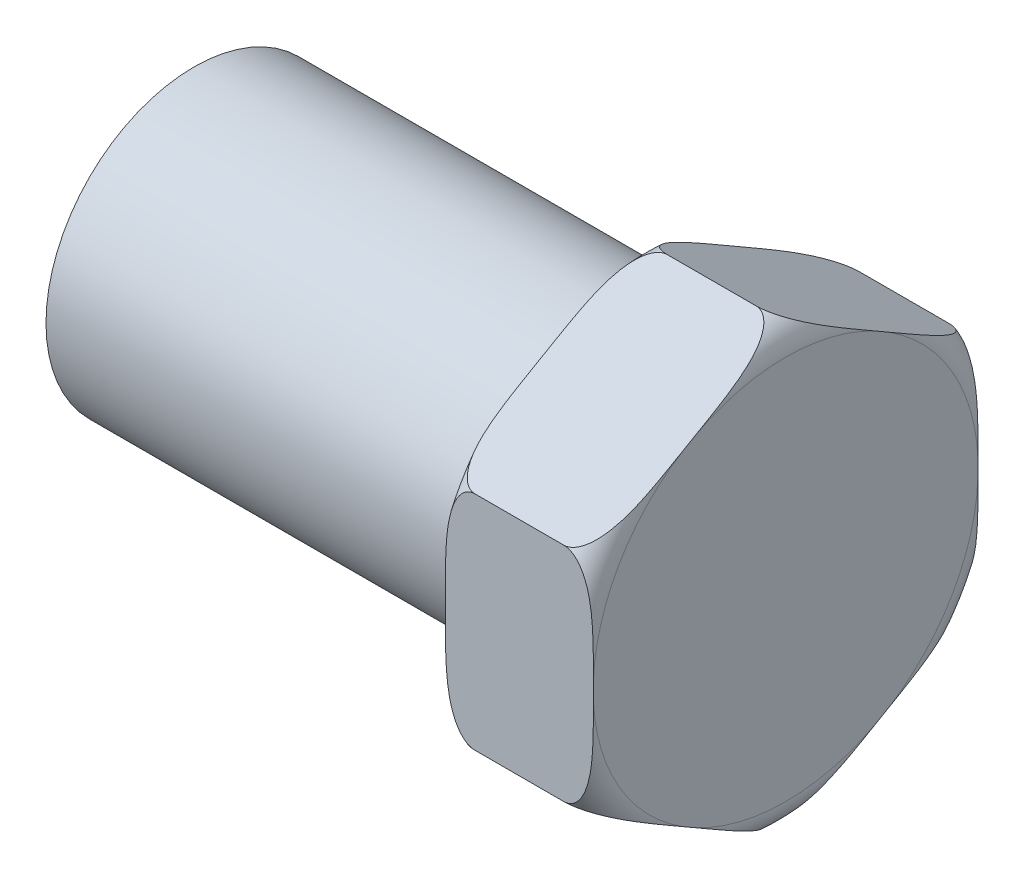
from build123d import *

# Parameters (mm, degrees)
SKETCH1_W      = 4.7625
SKETCH1_H      = 1.5875
EXTRUDE1_DEPTH = 1.5875


with BuildPart() as part:
    # Sketch1 → Revolve1 (revolve)
    with BuildSketch(Plane.XY, mode=Mode.PRIVATE) as revolve1_sk:
        with Locations((2.38125, 0.79375)):
            Rectangle(SKETCH1_W, SKETCH1_H)
    revolve(revolve1_sk.sketch.rotate(Axis((0, 0, 0), (1, 0, 0)), 90), axis=Axis((0, 0, 0), (1, 0, 0)))

    # Sketch2 → Extrude1 (add)
    with BuildSketch(Plane(origin=(4.7625, 0, 0), x_dir=(0, 0, -1), z_dir=(1, 0, 0))):
        Polygon((0, 2.383013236), (-2.06375, 1.191506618), (-2.06375, -1.191506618), (0, -2.383013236), (2.06375, -1.191506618), (2.06375, 1.191506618), align=None)
    extrude(amount=EXTRUDE1_DEPTH)

    # Sketch3 → Cut-Revolve1 (revolve, cut)
    with BuildSketch(Plane.XY):
        with BuildLine():
            Line((5.08, 2.383013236), (4.7625, 2.383013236))
            Line((4.7625, 2.383013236), (4.7625, 2.065513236))
            ThreePointArc((4.7625, 2.065513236), (4.855493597, 2.290019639), (5.08, 2.383013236))
        make_face()
        with BuildLine():
            Line((6.0325, 2.383013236), (6.35, 2.383013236))
            Line((6.35, 2.383013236), (6.35, 2.065513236))
            ThreePointArc((6.35, 2.065513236), (6.257006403, 2.290019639), (6.0325, 2.383013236))
        make_face()
    revolve(axis=Axis((0, 0, 0), (1, 0, 0)), mode=Mode.SUBTRACT)


solid = part.part
